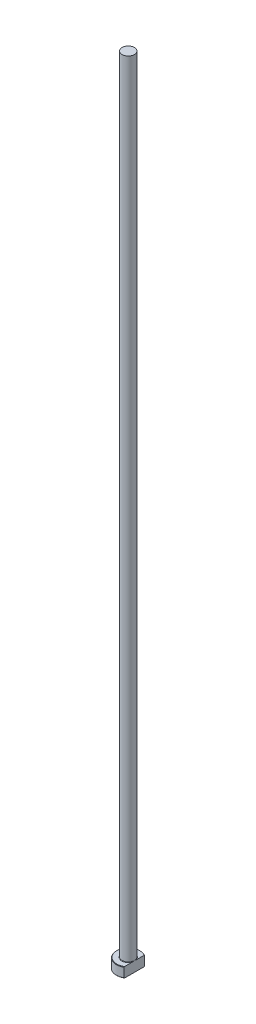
ISO-10303-21;
HEADER;
FILE_DESCRIPTION(('STEP AP214'),'2;1');
FILE_NAME('part.step','',(''),(''),'','','');
FILE_SCHEMA(('AUTOMOTIVE_DESIGN { 1 0 10303 214 1 1 1 1 }'));
ENDSEC;
DATA;
#1=APPLICATION_CONTEXT('core data for automotive mechanical design processes');
#2=APPLICATION_PROTOCOL_DEFINITION('international standard','automotive_design',2000,#1);
#3=PRODUCT_CONTEXT('',#1,'mechanical');
#4=PRODUCT('Part','Part','',(#3));
#5=PRODUCT_RELATED_PRODUCT_CATEGORY('part','',(#4));
#6=PRODUCT_DEFINITION_FORMATION('','',#4);
#7=PRODUCT_DEFINITION_CONTEXT('part definition',#1,'design');
#8=PRODUCT_DEFINITION('design','',#6,#7);
#9=PRODUCT_DEFINITION_SHAPE('','',#8);
#10=(LENGTH_UNIT() NAMED_UNIT(*) SI_UNIT(.MILLI.,.METRE.));
#11=(NAMED_UNIT(*) PLANE_ANGLE_UNIT() SI_UNIT($,.RADIAN.));
#12=(NAMED_UNIT(*) SI_UNIT($,.STERADIAN.) SOLID_ANGLE_UNIT());
#13=UNCERTAINTY_MEASURE_WITH_UNIT(LENGTH_MEASURE(1.E-05),#10,'distance_accuracy_value','');
#14=(GEOMETRIC_REPRESENTATION_CONTEXT(3) GLOBAL_UNCERTAINTY_ASSIGNED_CONTEXT((#13)) GLOBAL_UNIT_ASSIGNED_CONTEXT((#10,
#11,#12)) REPRESENTATION_CONTEXT('',''));
#15=CARTESIAN_POINT('',(0.,0.,0.));
#16=DIRECTION('',(0.,0.,1.));
#17=DIRECTION('',(1.,0.,0.));
#18=AXIS2_PLACEMENT_3D('',#15,#16,#17);
#19=CARTESIAN_POINT('',(0.,0.,0.));
#20=DIRECTION('',(0.,-1.,0.));
#21=DIRECTION('',(0.,0.,-1.));
#22=AXIS2_PLACEMENT_3D('',#19,#20,#21);
#23=PLANE('',#22);
#24=CARTESIAN_POINT('',(0.,0.,0.));
#25=DIRECTION('',(0.,-1.,0.));
#26=DIRECTION('',(0.,0.,-1.));
#27=AXIS2_PLACEMENT_3D('',#24,#25,#26);
#28=CIRCLE('',#27,5.79999999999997);
#29=CARTESIAN_POINT('',(3.09999999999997,0.,4.90204039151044));
#30=VERTEX_POINT('',#29);
#31=CARTESIAN_POINT('',(3.09999999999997,0.,-4.90204039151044));
#32=VERTEX_POINT('',#31);
#33=EDGE_CURVE('E98',#30,#32,#28,.T.);
#34=ORIENTED_EDGE('',*,*,#33,.T.);
#35=DIRECTION('',(0.,0.,1.));
#36=VECTOR('',#35,1.);
#37=CARTESIAN_POINT('',(3.09999999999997,0.,-5.13711981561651));
#38=LINE('',#37,#36);
#39=EDGE_CURVE('E83',#32,#30,#38,.T.);
#40=ORIENTED_EDGE('',*,*,#39,.T.);
#41=EDGE_LOOP('',(#34,#40));
#42=FACE_BOUND('',#41,.T.);
#43=ADVANCED_FACE('F32',(#42),#23,.T.);
#44=CARTESIAN_POINT('',(0.,259.958771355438,0.));
#45=DIRECTION('',(0.,1.,0.));
#46=DIRECTION('',(0.,0.,1.));
#47=AXIS2_PLACEMENT_3D('',#44,#45,#46);
#48=CYLINDRICAL_SURFACE('',#47,5.99999999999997);
#49=CARTESIAN_POINT('',(0.,4.80000000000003,0.));
#50=DIRECTION('',(0.,1.,0.));
#51=DIRECTION('',(0.,0.,1.));
#52=AXIS2_PLACEMENT_3D('',#49,#50,#51);
#53=CIRCLE('',#52,5.99999999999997);
#54=CARTESIAN_POINT('',(3.09999999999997,4.80000000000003,5.13711981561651));
#55=VERTEX_POINT('',#54);
#56=CARTESIAN_POINT('',(3.09999999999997,4.80000000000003,-5.13711981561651));
#57=VERTEX_POINT('',#56);
#58=EDGE_CURVE('E104',#55,#57,#53,.F.);
#59=ORIENTED_EDGE('',*,*,#58,.T.);
#60=DIRECTION('',(0.,-1.,0.));
#61=VECTOR('',#60,1.);
#62=CARTESIAN_POINT('',(3.09999999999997,400.,-5.13711981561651));
#63=LINE('',#62,#61);
#64=CARTESIAN_POINT('',(3.09999999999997,0.199999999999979,-5.13711981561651));
#65=VERTEX_POINT('',#64);
#66=EDGE_CURVE('E183',#57,#65,#63,.T.);
#67=ORIENTED_EDGE('',*,*,#66,.T.);
#68=CARTESIAN_POINT('',(0.,0.199999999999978,0.));
#69=DIRECTION('',(0.,-1.,0.));
#70=DIRECTION('',(0.,0.,-1.));
#71=AXIS2_PLACEMENT_3D('',#68,#69,#70);
#72=CIRCLE('',#71,5.99999999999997);
#73=CARTESIAN_POINT('',(3.09999999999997,0.199999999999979,5.13711981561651));
#74=VERTEX_POINT('',#73);
#75=EDGE_CURVE('E100',#65,#74,#72,.F.);
#76=ORIENTED_EDGE('',*,*,#75,.T.);
#77=DIRECTION('',(0.,-1.,0.));
#78=VECTOR('',#77,1.);
#79=CARTESIAN_POINT('',(3.09999999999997,400.,5.13711981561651));
#80=LINE('',#79,#78);
#81=EDGE_CURVE('E93',#55,#74,#80,.T.);
#82=ORIENTED_EDGE('',*,*,#81,.F.);
#83=EDGE_LOOP('',(#59,#67,#76,#82));
#84=FACE_BOUND('',#83,.T.);
#85=ADVANCED_FACE('F158',(#84),#48,.T.);
#86=CARTESIAN_POINT('',(-5.99999999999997,5.,0.));
#87=DIRECTION('',(0.,1.,0.));
#88=DIRECTION('',(0.,0.,1.));
#89=AXIS2_PLACEMENT_3D('',#86,#87,#88);
#90=PLANE('',#89);
#91=CARTESIAN_POINT('',(0.,5.,0.));
#92=DIRECTION('',(0.,1.,0.));
#93=DIRECTION('',(0.,0.,1.));
#94=AXIS2_PLACEMENT_3D('',#91,#92,#93);
#95=CIRCLE('',#94,5.79999999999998);
#96=CARTESIAN_POINT('',(3.09999999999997,5.,-4.90204039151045));
#97=VERTEX_POINT('',#96);
#98=CARTESIAN_POINT('',(3.09999999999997,5.,4.90204039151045));
#99=VERTEX_POINT('',#98);
#100=EDGE_CURVE('E178',#97,#99,#95,.T.);
#101=ORIENTED_EDGE('',*,*,#100,.T.);
#102=DIRECTION('',(0.,0.,-1.));
#103=VECTOR('',#102,1.);
#104=CARTESIAN_POINT('',(3.09999999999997,5.,0.));
#105=LINE('',#104,#103);
#106=CARTESIAN_POINT('',(3.09999999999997,4.99999999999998,1.13137084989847));
#107=VERTEX_POINT('',#106);
#108=EDGE_CURVE('E57',#99,#107,#105,.T.);
#109=ORIENTED_EDGE('',*,*,#108,.T.);
#110=CARTESIAN_POINT('',(0.,5.,0.));
#111=DIRECTION('',(0.,1.,0.));
#112=DIRECTION('',(0.,0.,1.));
#113=AXIS2_PLACEMENT_3D('',#110,#111,#112);
#114=CIRCLE('',#113,3.29999999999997);
#115=CARTESIAN_POINT('',(3.09999999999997,4.99999999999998,-1.13137084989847));
#116=VERTEX_POINT('',#115);
#117=EDGE_CURVE('E107',#107,#116,#114,.F.);
#118=ORIENTED_EDGE('',*,*,#117,.T.);
#119=EDGE_CURVE('E136',#116,#97,#105,.T.);
#120=ORIENTED_EDGE('',*,*,#119,.T.);
#121=EDGE_LOOP('',(#101,#109,#118,#120));
#122=FACE_BOUND('',#121,.T.);
#123=ADVANCED_FACE('F147',(#122),#90,.T.);
#124=CARTESIAN_POINT('',(0.,5.,0.));
#125=DIRECTION('',(0.,-1.,0.));
#126=DIRECTION('',(0.,0.,-1.));
#127=AXIS2_PLACEMENT_3D('',#124,#125,#126);
#128=CONICAL_SURFACE('',#127,5.79999999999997,0.785398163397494);
#129=ORIENTED_EDGE('',*,*,#58,.F.);
#130=CARTESIAN_POINT('',(3.09999999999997,-0.920431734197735,11.3030314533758));
#131=CARTESIAN_POINT('',(3.09999999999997,-0.688619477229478,11.0626468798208));
#132=CARTESIAN_POINT('',(3.09999999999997,-0.457063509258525,10.8220144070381));
#133=CARTESIAN_POINT('',(3.09999999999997,0.00539791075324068,10.3401205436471));
#134=CARTESIAN_POINT('',(3.09999999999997,0.236303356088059,10.0988591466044));
#135=CARTESIAN_POINT('',(3.09999999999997,0.69741098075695,9.61548494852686));
#136=CARTESIAN_POINT('',(3.09999999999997,0.927612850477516,9.3733718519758));
#137=CARTESIAN_POINT('',(3.09999999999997,1.38702344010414,8.88820676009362));
#138=CARTESIAN_POINT('',(3.09999999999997,1.61623216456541,8.64515476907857));
#139=CARTESIAN_POINT('',(3.09999999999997,2.06943803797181,8.16208218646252));
#140=CARTESIAN_POINT('',(3.09999999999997,2.29345676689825,7.92208185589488));
#141=CARTESIAN_POINT('',(3.09999999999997,2.73992554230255,7.4406269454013));
#142=CARTESIAN_POINT('',(3.09999999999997,2.96237559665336,7.19917237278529));
#143=CARTESIAN_POINT('',(3.09999999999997,3.40516728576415,6.71440911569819));
#144=CARTESIAN_POINT('',(3.09999999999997,3.6255092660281,6.47110074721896));
#145=CARTESIAN_POINT('',(3.09999999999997,4.06338097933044,5.98197014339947));
#146=CARTESIAN_POINT('',(3.09999999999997,4.28091078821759,5.736147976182));
#147=CARTESIAN_POINT('',(3.09999999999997,4.64723250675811,5.31542741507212));
#148=CARTESIAN_POINT('',(3.09999999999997,4.79703819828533,5.14141294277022));
#149=CARTESIAN_POINT('',(3.09999999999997,5.09412273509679,4.7912056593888));
#150=CARTESIAN_POINT('',(3.09999999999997,5.24140133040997,4.61501263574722));
#151=CARTESIAN_POINT('',(3.09999999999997,5.5340047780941,4.25808346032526));
#152=CARTESIAN_POINT('',(3.09999999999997,5.67929603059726,4.07731963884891));
#153=CARTESIAN_POINT('',(3.09999999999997,5.96506147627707,3.71208453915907));
#154=CARTESIAN_POINT('',(3.09999999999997,6.10553688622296,3.52761421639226));
#155=CARTESIAN_POINT('',(3.09999999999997,6.38162972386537,3.15098880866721));
#156=CARTESIAN_POINT('',(3.09999999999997,6.5171507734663,2.95876205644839));
#157=CARTESIAN_POINT('',(3.09999999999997,6.71260042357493,2.66498269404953));
#158=CARTESIAN_POINT('',(3.09999999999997,6.77649142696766,2.56607098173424));
#159=CARTESIAN_POINT('',(3.09999999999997,6.90093996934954,2.36617934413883));
#160=CARTESIAN_POINT('',(3.09999999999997,6.96149785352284,2.26519963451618));
#161=CARTESIAN_POINT('',(3.09999999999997,7.07778312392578,2.06197879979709));
#162=CARTESIAN_POINT('',(3.09999999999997,7.13355741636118,1.9597648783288));
#163=CARTESIAN_POINT('',(3.09999999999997,7.23993773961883,1.75269687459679));
#164=CARTESIAN_POINT('',(3.09999999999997,7.29054278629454,1.64784229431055));
#165=CARTESIAN_POINT('',(3.09999999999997,7.43232844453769,1.329374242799));
#166=CARTESIAN_POINT('',(3.09999999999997,7.51393038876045,1.11110705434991));
#167=CARTESIAN_POINT('',(3.09999999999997,7.60389052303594,0.78418122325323));
#168=CARTESIAN_POINT('',(3.09999999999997,7.62802295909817,0.679829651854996));
#169=CARTESIAN_POINT('',(3.09999999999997,7.66638713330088,0.46928482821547));
#170=CARTESIAN_POINT('',(3.09999999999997,7.68061997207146,0.363091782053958));
#171=CARTESIAN_POINT('',(3.09999999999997,7.69816738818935,0.150218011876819));
#172=CARTESIAN_POINT('',(3.09999999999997,7.70152516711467,0.0435409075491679));
#173=CARTESIAN_POINT('',(3.09999999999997,7.69719360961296,-0.169591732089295));
#174=CARTESIAN_POINT('',(3.09999999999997,7.68950359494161,-0.276047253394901));
#175=CARTESIAN_POINT('',(3.09999999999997,7.66373252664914,-0.486880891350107));
#176=CARTESIAN_POINT('',(3.09999999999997,7.64572733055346,-0.591268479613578));
#177=CARTESIAN_POINT('',(3.09999999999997,7.60052536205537,-0.798013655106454));
#178=CARTESIAN_POINT('',(3.09999999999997,7.57332729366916,-0.900370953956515));
#179=CARTESIAN_POINT('',(3.09999999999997,7.51094394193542,-1.10330613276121));
#180=CARTESIAN_POINT('',(3.09999999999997,7.47570859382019,-1.20386840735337));
#181=CARTESIAN_POINT('',(3.09999999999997,7.39875968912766,-1.40242722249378));
#182=CARTESIAN_POINT('',(3.09999999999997,7.35704736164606,-1.50042424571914));
#183=CARTESIAN_POINT('',(3.09999999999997,7.22811120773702,-1.78198575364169));
#184=CARTESIAN_POINT('',(3.09999999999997,7.13397777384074,-1.96237556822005));
#185=CARTESIAN_POINT('',(3.09999999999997,6.93309444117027,-2.31605883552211));
#186=CARTESIAN_POINT('',(3.09999999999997,6.82632930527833,-2.48934337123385));
#187=CARTESIAN_POINT('',(3.09999999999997,6.60386158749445,-2.83097436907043));
#188=CARTESIAN_POINT('',(3.09999999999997,6.48812633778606,-2.99929937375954));
#189=CARTESIAN_POINT('',(3.09999999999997,6.2507350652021,-3.33155975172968));
#190=CARTESIAN_POINT('',(3.09999999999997,6.12908188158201,-3.49549717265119));
#191=CARTESIAN_POINT('',(3.09999999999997,5.87989164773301,-3.82213838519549));
#192=CARTESIAN_POINT('',(3.09999999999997,5.75229938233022,-3.98479985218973));
#193=CARTESIAN_POINT('',(3.09999999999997,5.49383773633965,-4.30751445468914));
#194=CARTESIAN_POINT('',(3.09999999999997,5.36296802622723,-4.46756732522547));
#195=CARTESIAN_POINT('',(3.09999999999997,5.09906242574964,-4.78523580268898));
#196=CARTESIAN_POINT('',(3.09999999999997,4.96603235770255,-4.94285625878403));
#197=CARTESIAN_POINT('',(3.09999999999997,4.69805373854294,-5.25645943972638));
#198=CARTESIAN_POINT('',(3.09999999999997,4.56310515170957,-5.41244213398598));
#199=CARTESIAN_POINT('',(3.09999999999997,4.2080943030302,-5.81877937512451));
#200=CARTESIAN_POINT('',(3.09999999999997,3.98681570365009,-6.06807041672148));
#201=CARTESIAN_POINT('',(3.09999999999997,3.54147161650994,-6.56415415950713));
#202=CARTESIAN_POINT('',(3.09999999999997,3.31740605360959,-6.8109467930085));
#203=CARTESIAN_POINT('',(3.09999999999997,2.86701901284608,-7.30287446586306));
#204=CARTESIAN_POINT('',(3.09999999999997,2.64069567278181,-7.54800779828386));
#205=CARTESIAN_POINT('',(3.09999999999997,2.18649425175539,-8.0368296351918));
#206=CARTESIAN_POINT('',(3.09999999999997,1.95861616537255,-8.28051813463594));
#207=CARTESIAN_POINT('',(3.09999999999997,1.5108345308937,-8.75699429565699));
#208=CARTESIAN_POINT('',(3.09999999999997,1.29097841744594,-8.98982656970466));
#209=CARTESIAN_POINT('',(3.09999999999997,0.850379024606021,-9.4546514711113));
#210=CARTESIAN_POINT('',(3.09999999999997,0.629635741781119,-9.68664409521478));
#211=CARTESIAN_POINT('',(3.09999999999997,0.187673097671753,-10.1496925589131));
#212=CARTESIAN_POINT('',(3.09999999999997,-0.0335454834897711,-10.3807491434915));
#213=CARTESIAN_POINT('',(3.09999999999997,-0.476574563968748,-10.8422904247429));
#214=CARTESIAN_POINT('',(3.09999999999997,-0.698385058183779,-11.0727751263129));
#215=CARTESIAN_POINT('',(3.09999999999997,-0.920431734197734,-11.3030314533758));
#216=B_SPLINE_CURVE_WITH_KNOTS('',3,(#130,#131,#132,#133,#134,#135,#136,#137,#138,#139,#140,
#141,#142,#143,#144,#145,#146,#147,#148,#149,#150,#151,#152,#153,#154,#155,#156,#157,#158,#159,
#160,#161,#162,#163,#164,#165,#166,#167,#168,#169,#170,#171,#172,#173,#174,#175,#176,#177,#178,
#179,#180,#181,#182,#183,#184,#185,#186,#187,#188,#189,#190,#191,#192,#193,#194,#195,#196,#197,
#198,#199,#200,#201,#202,#203,#204,#205,#206,#207,#208,#209,#210,#211,#212,#213,#214,#215),
.UNSPECIFIED.,.F.,.F.,(4,2,2,2,2,2,2,2,2,2,2,2,2,2,2,2,2,2,2,2,2,2,2,2,2,2,2,2,2,2,2,2,2,2,2,2,
2,2,2,2,2,2,4),(0.,1.00184641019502,2.00370311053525,3.00595078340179,4.00819385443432,
4.9931053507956,5.97801190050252,6.9627541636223,7.94746981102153,8.6362949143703,
9.32518776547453,10.0208755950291,10.7163863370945,11.421700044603,11.7749044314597,
12.1280721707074,12.4772435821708,12.8264813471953,13.5223439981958,13.8432758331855,
14.1641719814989,14.4837917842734,14.8034312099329,15.1207496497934,15.4381128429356,
15.7575096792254,16.0768459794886,16.6863983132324,17.296693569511,17.9093265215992,
18.5216683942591,19.1418114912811,19.7620171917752,20.3807633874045,20.9995211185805,
21.9994842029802,22.9994743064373,24.0003716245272,25.0012724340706,25.961961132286,
26.9226535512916,27.882299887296,28.8419379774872),.UNSPECIFIED.);
#217=EDGE_CURVE('E135',#55,#99,#216,.T.);
#218=ORIENTED_EDGE('',*,*,#217,.T.);
#219=ORIENTED_EDGE('',*,*,#100,.F.);
#220=EDGE_CURVE('E127',#97,#57,#216,.T.);
#221=ORIENTED_EDGE('',*,*,#220,.T.);
#222=EDGE_LOOP('',(#129,#218,#219,#221));
#223=FACE_BOUND('',#222,.T.);
#224=ADVANCED_FACE('F143',(#223),#128,.T.);
#225=CARTESIAN_POINT('',(0.,0.199999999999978,0.));
#226=DIRECTION('',(0.,1.,0.));
#227=DIRECTION('',(0.,0.,1.));
#228=AXIS2_PLACEMENT_3D('',#225,#226,#227);
#229=CONICAL_SURFACE('',#228,5.99999999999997,0.785398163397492);
#230=ORIENTED_EDGE('',*,*,#75,.F.);
#231=CARTESIAN_POINT('',(3.09999999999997,5.92043173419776,-11.3030314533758));
#232=CARTESIAN_POINT('',(3.09999999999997,5.68861947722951,-11.0626468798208));
#233=CARTESIAN_POINT('',(3.09999999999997,5.45706350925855,-10.8220144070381));
#234=CARTESIAN_POINT('',(3.09999999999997,4.99460208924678,-10.3401205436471));
#235=CARTESIAN_POINT('',(3.09999999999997,4.76369664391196,-10.0988591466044));
#236=CARTESIAN_POINT('',(3.09999999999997,4.30258901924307,-9.61548494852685));
#237=CARTESIAN_POINT('',(3.09999999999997,4.0723871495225,-9.37337185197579));
#238=CARTESIAN_POINT('',(3.09999999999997,3.61297655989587,-8.88820676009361));
#239=CARTESIAN_POINT('',(3.09999999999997,3.3837678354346,-8.64515476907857));
#240=CARTESIAN_POINT('',(3.09999999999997,2.9305619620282,-8.16208218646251));
#241=CARTESIAN_POINT('',(3.09999999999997,2.70654323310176,-7.92208185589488));
#242=CARTESIAN_POINT('',(3.09999999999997,2.26007445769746,-7.4406269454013));
#243=CARTESIAN_POINT('',(3.09999999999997,2.03762440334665,-7.19917237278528));
#244=CARTESIAN_POINT('',(3.09999999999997,1.59483271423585,-6.71440911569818));
#245=CARTESIAN_POINT('',(3.09999999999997,1.3744907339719,-6.47110074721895));
#246=CARTESIAN_POINT('',(3.09999999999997,0.936619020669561,-5.98197014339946));
#247=CARTESIAN_POINT('',(3.09999999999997,0.719089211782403,-5.73614797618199));
#248=CARTESIAN_POINT('',(3.09999999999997,0.352767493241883,-5.31542741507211));
#249=CARTESIAN_POINT('',(3.09999999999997,0.202961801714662,-5.14141294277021));
#250=CARTESIAN_POINT('',(3.09999999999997,-0.0941227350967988,-4.79120565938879));
#251=CARTESIAN_POINT('',(3.09999999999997,-0.241401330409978,-4.61501263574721));
#252=CARTESIAN_POINT('',(3.09999999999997,-0.534004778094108,-4.25808346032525));
#253=CARTESIAN_POINT('',(3.09999999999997,-0.679296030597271,-4.0773196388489));
#254=CARTESIAN_POINT('',(3.09999999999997,-0.96506147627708,-3.71208453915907));
#255=CARTESIAN_POINT('',(3.09999999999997,-1.10553688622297,-3.52761421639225));
#256=CARTESIAN_POINT('',(3.09999999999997,-1.38162972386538,-3.1509888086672));
#257=CARTESIAN_POINT('',(3.09999999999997,-1.51715077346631,-2.95876205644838));
#258=CARTESIAN_POINT('',(3.09999999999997,-1.71260042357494,-2.66498269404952));
#259=CARTESIAN_POINT('',(3.09999999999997,-1.77649142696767,-2.56607098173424));
#260=CARTESIAN_POINT('',(3.09999999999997,-1.90093996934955,-2.36617934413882));
#261=CARTESIAN_POINT('',(3.09999999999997,-1.96149785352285,-2.26519963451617));
#262=CARTESIAN_POINT('',(3.09999999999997,-2.07778312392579,-2.06197879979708));
#263=CARTESIAN_POINT('',(3.09999999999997,-2.13355741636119,-1.95976487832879));
#264=CARTESIAN_POINT('',(3.09999999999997,-2.23993773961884,-1.75269687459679));
#265=CARTESIAN_POINT('',(3.09999999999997,-2.29054278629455,-1.64784229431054));
#266=CARTESIAN_POINT('',(3.09999999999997,-2.4323284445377,-1.329374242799));
#267=CARTESIAN_POINT('',(3.09999999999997,-2.51393038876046,-1.1111070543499));
#268=CARTESIAN_POINT('',(3.09999999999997,-2.60389052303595,-0.784181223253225));
#269=CARTESIAN_POINT('',(3.09999999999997,-2.62802295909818,-0.679829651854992));
#270=CARTESIAN_POINT('',(3.09999999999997,-2.66638713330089,-0.469284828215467));
#271=CARTESIAN_POINT('',(3.09999999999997,-2.68061997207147,-0.363091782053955));
#272=CARTESIAN_POINT('',(3.09999999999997,-2.69816738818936,-0.150218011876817));
#273=CARTESIAN_POINT('',(3.09999999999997,-2.70152516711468,-0.043540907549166));
#274=CARTESIAN_POINT('',(3.09999999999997,-2.69719360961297,0.169591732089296));
#275=CARTESIAN_POINT('',(3.09999999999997,-2.68950359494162,0.276047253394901));
#276=CARTESIAN_POINT('',(3.09999999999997,-2.66373252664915,0.486880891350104));
#277=CARTESIAN_POINT('',(3.09999999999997,-2.64572733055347,0.591268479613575));
#278=CARTESIAN_POINT('',(3.09999999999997,-2.60052536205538,0.798013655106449));
#279=CARTESIAN_POINT('',(3.09999999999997,-2.57332729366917,0.900370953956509));
#280=CARTESIAN_POINT('',(3.09999999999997,-2.51094394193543,1.10330613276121));
#281=CARTESIAN_POINT('',(3.09999999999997,-2.4757085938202,1.20386840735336));
#282=CARTESIAN_POINT('',(3.09999999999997,-2.39875968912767,1.40242722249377));
#283=CARTESIAN_POINT('',(3.09999999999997,-2.35704736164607,1.50042424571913));
#284=CARTESIAN_POINT('',(3.09999999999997,-2.22811120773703,1.78198575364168));
#285=CARTESIAN_POINT('',(3.09999999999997,-2.13397777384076,1.96237556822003));
#286=CARTESIAN_POINT('',(3.09999999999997,-1.93309444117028,2.31605883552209));
#287=CARTESIAN_POINT('',(3.09999999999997,-1.82632930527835,2.48934337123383));
#288=CARTESIAN_POINT('',(3.09999999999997,-1.60386158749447,2.8309743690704));
#289=CARTESIAN_POINT('',(3.09999999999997,-1.48812633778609,2.99929937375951));
#290=CARTESIAN_POINT('',(3.09999999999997,-1.25073506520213,3.33155975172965));
#291=CARTESIAN_POINT('',(3.09999999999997,-1.12908188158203,3.49549717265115));
#292=CARTESIAN_POINT('',(3.09999999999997,-0.87989164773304,3.82213838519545));
#293=CARTESIAN_POINT('',(3.09999999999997,-0.752299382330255,3.98479985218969));
#294=CARTESIAN_POINT('',(3.09999999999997,-0.493837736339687,4.30751445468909));
#295=CARTESIAN_POINT('',(3.09999999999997,-0.362968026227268,4.46756732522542));
#296=CARTESIAN_POINT('',(3.09999999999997,-0.0990624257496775,4.78523580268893));
#297=CARTESIAN_POINT('',(3.09999999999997,0.033967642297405,4.94285625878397));
#298=CARTESIAN_POINT('',(3.09999999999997,0.301946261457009,5.25645943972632));
#299=CARTESIAN_POINT('',(3.09999999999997,0.436894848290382,5.41244213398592));
#300=CARTESIAN_POINT('',(3.09999999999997,0.791905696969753,5.81877937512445));
#301=CARTESIAN_POINT('',(3.09999999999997,1.01318429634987,6.06807041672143));
#302=CARTESIAN_POINT('',(3.09999999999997,1.45852838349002,6.56415415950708));
#303=CARTESIAN_POINT('',(3.09999999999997,1.68259394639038,6.81094679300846));
#304=CARTESIAN_POINT('',(3.09999999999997,2.1329809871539,7.30287446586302));
#305=CARTESIAN_POINT('',(3.09999999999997,2.35930432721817,7.54800779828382));
#306=CARTESIAN_POINT('',(3.09999999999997,2.8135057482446,8.03682963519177));
#307=CARTESIAN_POINT('',(3.09999999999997,3.04138383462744,8.28051813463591));
#308=CARTESIAN_POINT('',(3.09999999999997,3.48916546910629,8.75699429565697));
#309=CARTESIAN_POINT('',(3.09999999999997,3.70902158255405,8.98982656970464));
#310=CARTESIAN_POINT('',(3.09999999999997,4.14962097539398,9.45465147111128));
#311=CARTESIAN_POINT('',(3.09999999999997,4.37036425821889,9.68664409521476));
#312=CARTESIAN_POINT('',(3.09999999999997,4.81232690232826,10.1496925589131));
#313=CARTESIAN_POINT('',(3.09999999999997,5.03354548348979,10.3807491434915));
#314=CARTESIAN_POINT('',(3.09999999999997,5.47657456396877,10.8422904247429));
#315=CARTESIAN_POINT('',(3.09999999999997,5.69838505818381,11.0727751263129));
#316=CARTESIAN_POINT('',(3.09999999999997,5.92043173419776,11.3030314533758));
#317=B_SPLINE_CURVE_WITH_KNOTS('',3,(#231,#232,#233,#234,#235,#236,#237,#238,#239,#240,#241,
#242,#243,#244,#245,#246,#247,#248,#249,#250,#251,#252,#253,#254,#255,#256,#257,#258,#259,#260,
#261,#262,#263,#264,#265,#266,#267,#268,#269,#270,#271,#272,#273,#274,#275,#276,#277,#278,#279,
#280,#281,#282,#283,#284,#285,#286,#287,#288,#289,#290,#291,#292,#293,#294,#295,#296,#297,#298,
#299,#300,#301,#302,#303,#304,#305,#306,#307,#308,#309,#310,#311,#312,#313,#314,#315,#316),
.UNSPECIFIED.,.F.,.F.,(4,2,2,2,2,2,2,2,2,2,2,2,2,2,2,2,2,2,2,2,2,2,2,2,2,2,2,2,2,2,2,2,2,2,2,2,
2,2,2,2,2,2,4),(0.,1.00184641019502,2.00370311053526,3.0059507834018,4.00819385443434,
4.99310535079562,5.97801190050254,6.96275416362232,7.94746981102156,8.63629491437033,
9.32518776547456,10.0208755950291,10.7163863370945,11.421700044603,11.7749044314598,
12.1280721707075,12.4772435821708,12.8264813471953,13.5223439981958,13.8432758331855,
14.1641719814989,14.4837917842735,14.8034312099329,15.1207496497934,15.4381128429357,
15.7575096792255,16.0768459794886,16.6863983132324,17.296693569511,17.9093265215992,
18.5216683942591,19.1418114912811,19.7620171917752,20.3807633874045,20.9995211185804,
21.9994842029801,22.9994743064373,24.0003716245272,25.0012724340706,25.961961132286,
26.9226535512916,27.8822998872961,28.8419379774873),.UNSPECIFIED.);
#318=EDGE_CURVE('E86',#65,#32,#317,.T.);
#319=ORIENTED_EDGE('',*,*,#318,.T.);
#320=ORIENTED_EDGE('',*,*,#33,.F.);
#321=EDGE_CURVE('E89',#30,#74,#317,.T.);
#322=ORIENTED_EDGE('',*,*,#321,.T.);
#323=EDGE_LOOP('',(#230,#319,#320,#322));
#324=FACE_BOUND('',#323,.T.);
#325=ADVANCED_FACE('F97',(#324),#229,.T.);
#326=CARTESIAN_POINT('',(0.,5.19999999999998,0.));
#327=DIRECTION('',(0.,1.,0.));
#328=DIRECTION('',(0.,0.,1.));
#329=AXIS2_PLACEMENT_3D('',#326,#327,#328);
#330=TOROIDAL_SURFACE('',#329,3.29999999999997,0.2);
#331=CARTESIAN_POINT('',(3.09999999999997,5.19999999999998,0.));
#332=CARTESIAN_POINT('',(3.09999999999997,5.20000050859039,8.63470448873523E-11));
#333=CARTESIAN_POINT('',(3.09999999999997,5.20000101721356,-1.96831350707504E-07));
#334=CARTESIAN_POINT('',(3.09999999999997,5.20000196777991,-7.43387548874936E-07));
#335=CARTESIAN_POINT('',(3.09999999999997,5.20000239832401,-1.10608751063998E-06));
#336=CARTESIAN_POINT('',(3.09999999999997,5.20000329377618,-1.97482885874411E-06));
#337=CARTESIAN_POINT('',(3.09999999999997,5.20000374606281,-2.49491365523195E-06));
#338=CARTESIAN_POINT('',(3.09999999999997,5.20000455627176,-3.57320004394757E-06));
#339=CARTESIAN_POINT('',(3.09999999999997,5.20000491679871,-4.12959627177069E-06));
#340=CARTESIAN_POINT('',(3.09999999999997,5.20000625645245,-6.28443543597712E-06));
#341=CARTESIAN_POINT('',(3.09999999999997,5.20000716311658,-7.93057681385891E-06));
#342=CARTESIAN_POINT('',(3.09999999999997,5.20000865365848,-1.11908861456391E-05));
#343=CARTESIAN_POINT('',(3.09999999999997,5.20000925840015,-1.27959111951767E-05));
#344=CARTESIAN_POINT('',(3.09999999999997,5.20001179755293,-1.95895744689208E-05));
#345=CARTESIAN_POINT('',(3.09999999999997,5.20001369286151,-2.47960258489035E-05));
#346=CARTESIAN_POINT('',(3.09999999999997,5.20001648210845,-3.46313916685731E-05));
#347=CARTESIAN_POINT('',(3.09999999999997,5.20001748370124,-3.9229578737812E-05));
#348=CARTESIAN_POINT('',(3.09999999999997,5.20002478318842,-7.34062169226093E-05));
#349=CARTESIAN_POINT('',(3.09999999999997,5.20003031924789,-0.000103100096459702));
#350=CARTESIAN_POINT('',(3.09999999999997,5.20005455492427,-0.000220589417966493));
#351=CARTESIAN_POINT('',(3.09999999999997,5.2000776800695,-0.000307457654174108));
#352=CARTESIAN_POINT('',(3.09999999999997,5.20016786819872,-0.000651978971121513));
#353=CARTESIAN_POINT('',(3.09999999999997,5.20023206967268,-0.000910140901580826));
#354=CARTESIAN_POINT('',(3.09999999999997,5.2004894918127,-0.00193760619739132));
#355=CARTESIAN_POINT('',(3.09999999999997,5.20068632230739,-0.00270624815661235));
#356=CARTESIAN_POINT('',(3.09999999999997,5.20150547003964,-0.00591366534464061));
#357=CARTESIAN_POINT('',(3.09999999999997,5.20212323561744,-0.00835327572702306));
#358=CARTESIAN_POINT('',(3.09999999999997,5.2072994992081,-0.0287840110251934));
#359=CARTESIAN_POINT('',(3.09999999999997,5.21187465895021,-0.046772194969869));
#360=CARTESIAN_POINT('',(3.09999999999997,5.22081406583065,-0.0820386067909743));
#361=CARTESIAN_POINT('',(3.09999999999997,5.22517945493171,-0.0993165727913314));
#362=CARTESIAN_POINT('',(3.09999999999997,5.23938711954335,-0.155760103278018));
#363=CARTESIAN_POINT('',(3.09999999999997,5.24916620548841,-0.19494192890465));
#364=CARTESIAN_POINT('',(3.09999999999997,5.26559812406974,-0.262010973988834));
#365=CARTESIAN_POINT('',(3.09999999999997,5.27233495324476,-0.289877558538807));
#366=CARTESIAN_POINT('',(3.09999999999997,5.28539894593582,-0.344925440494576));
#367=CARTESIAN_POINT('',(3.09999999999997,5.2917322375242,-0.372105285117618));
#368=CARTESIAN_POINT('',(3.09999999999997,5.3104657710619,-0.454441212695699));
#369=CARTESIAN_POINT('',(3.09999999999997,5.32242624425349,-0.509699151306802));
#370=CARTESIAN_POINT('',(3.09999999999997,5.34470875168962,-0.621095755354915));
#371=CARTESIAN_POINT('',(3.09999999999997,5.35501420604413,-0.677237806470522));
#372=CARTESIAN_POINT('',(3.09999999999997,5.37397233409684,-0.795308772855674));
#373=CARTESIAN_POINT('',(3.09999999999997,5.38237372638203,-0.857279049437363));
#374=CARTESIAN_POINT('',(3.09999999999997,5.39483964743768,-0.981488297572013));
#375=CARTESIAN_POINT('',(3.09999999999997,5.39891956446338,-1.04372551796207));
#376=CARTESIAN_POINT('',(3.09999999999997,5.4002522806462,-1.1364625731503));
#377=CARTESIAN_POINT('',(3.09999999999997,5.39992868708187,-1.16692514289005));
#378=CARTESIAN_POINT('',(3.09999999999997,5.39736890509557,-1.22783403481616));
#379=CARTESIAN_POINT('',(3.09999999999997,5.39512949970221,-1.25828024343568));
#380=CARTESIAN_POINT('',(3.09999999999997,5.3882758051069,-1.31816284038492));
#381=CARTESIAN_POINT('',(3.09999999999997,5.38372059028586,-1.34760578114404));
#382=CARTESIAN_POINT('',(3.09999999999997,5.37149785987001,-1.40581436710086));
#383=CARTESIAN_POINT('',(3.09999999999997,5.36383981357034,-1.43458179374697));
#384=CARTESIAN_POINT('',(3.09999999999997,5.34913051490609,-1.47610977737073));
#385=CARTESIAN_POINT('',(3.09999999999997,5.34380195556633,-1.48947638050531));
#386=CARTESIAN_POINT('',(3.09999999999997,5.33179609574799,-1.51565425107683));
#387=CARTESIAN_POINT('',(3.09999999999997,5.32511527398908,-1.52846396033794));
#388=CARTESIAN_POINT('',(3.09999999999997,5.31156812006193,-1.55058530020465));
#389=CARTESIAN_POINT('',(3.09999999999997,5.30500876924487,-1.56008264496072));
#390=CARTESIAN_POINT('',(3.09999999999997,5.29056237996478,-1.5780097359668));
#391=CARTESIAN_POINT('',(3.09999999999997,5.28267975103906,-1.58644287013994));
#392=CARTESIAN_POINT('',(3.09999999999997,5.26899499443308,-1.59836257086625));
#393=CARTESIAN_POINT('',(3.09999999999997,5.26370979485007,-1.60243897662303));
#394=CARTESIAN_POINT('',(3.09999999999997,5.25259769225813,-1.60977856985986));
#395=CARTESIAN_POINT('',(3.09999999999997,5.24677147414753,-1.61304276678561));
#396=CARTESIAN_POINT('',(3.09999999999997,5.23558966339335,-1.61807105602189));
#397=CARTESIAN_POINT('',(3.09999999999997,5.23030479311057,-1.61999055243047));
#398=CARTESIAN_POINT('',(3.09999999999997,5.21948724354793,-1.62291762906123));
#399=CARTESIAN_POINT('',(3.09999999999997,5.21395478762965,-1.62392601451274));
#400=CARTESIAN_POINT('',(3.09999999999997,5.20277366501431,-1.62493544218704));
#401=CARTESIAN_POINT('',(3.09999999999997,5.19712461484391,-1.62493233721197));
#402=CARTESIAN_POINT('',(3.09999999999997,5.18591949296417,-1.62390846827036));
#403=CARTESIAN_POINT('',(3.09999999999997,5.1803634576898,-1.62288731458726));
#404=CARTESIAN_POINT('',(3.09999999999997,5.16982009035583,-1.62001450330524));
#405=CARTESIAN_POINT('',(3.09999999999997,5.16481843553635,-1.61821408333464));
#406=CARTESIAN_POINT('',(3.09999999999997,5.15512149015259,-1.61392929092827));
#407=CARTESIAN_POINT('',(3.09999999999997,5.15042629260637,-1.61144471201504));
#408=CARTESIAN_POINT('',(3.09999999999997,5.13843536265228,-1.60413057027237));
#409=CARTESIAN_POINT('',(3.09999999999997,5.13143004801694,-1.59882575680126));
#410=CARTESIAN_POINT('',(3.09999999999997,5.11831643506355,-1.5871999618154));
#411=CARTESIAN_POINT('',(3.09999999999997,5.1122112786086,-1.58087557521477));
#412=CARTESIAN_POINT('',(3.09999999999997,5.09648912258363,-1.56251896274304));
#413=CARTESIAN_POINT('',(3.09999999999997,5.08770172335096,-1.54978301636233));
#414=CARTESIAN_POINT('',(3.09999999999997,5.07201622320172,-1.52323986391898));
#415=CARTESIAN_POINT('',(3.09999999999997,5.06512028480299,-1.50943145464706));
#416=CARTESIAN_POINT('',(3.09999999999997,5.05247518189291,-1.48047677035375));
#417=CARTESIAN_POINT('',(3.09999999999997,5.04680124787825,-1.46529814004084));
#418=CARTESIAN_POINT('',(3.09999999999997,5.03672275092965,-1.43451819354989));
#419=CARTESIAN_POINT('',(3.09999999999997,5.03231964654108,-1.41891641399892));
#420=CARTESIAN_POINT('',(3.09999999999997,5.02058030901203,-1.37142005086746));
#421=CARTESIAN_POINT('',(3.09999999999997,5.01483238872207,-1.3391366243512));
#422=CARTESIAN_POINT('',(3.09999999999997,5.00376797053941,-1.25503165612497));
#423=CARTESIAN_POINT('',(3.09999999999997,5.00071471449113,-1.20294070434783));
#424=CARTESIAN_POINT('',(3.09999999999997,4.99950954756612,-1.09856941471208));
#425=CARTESIAN_POINT('',(3.09999999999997,5.00137734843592,-1.04628915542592));
#426=CARTESIAN_POINT('',(3.09999999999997,5.00844280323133,-0.944923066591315));
#427=CARTESIAN_POINT('',(3.09999999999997,5.01344756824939,-0.895822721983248));
#428=CARTESIAN_POINT('',(3.09999999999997,5.02575896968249,-0.798308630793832));
#429=CARTESIAN_POINT('',(3.09999999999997,5.03304750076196,-0.749892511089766));
#430=CARTESIAN_POINT('',(3.09999999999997,5.04953811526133,-0.652335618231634));
#431=CARTESIAN_POINT('',(3.09999999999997,5.05877753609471,-0.603201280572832));
#432=CARTESIAN_POINT('',(3.09999999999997,5.07884455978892,-0.503941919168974));
#433=CARTESIAN_POINT('',(3.09999999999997,5.08970698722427,-0.453824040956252));
#434=CARTESIAN_POINT('',(3.09999999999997,5.10895219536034,-0.369008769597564));
#435=CARTESIAN_POINT('',(3.09999999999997,5.11708529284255,-0.334253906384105));
#436=CARTESIAN_POINT('',(3.09999999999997,5.13360118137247,-0.265211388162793));
#437=CARTESIAN_POINT('',(3.09999999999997,5.14198019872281,-0.230922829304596));
#438=CARTESIAN_POINT('',(3.09999999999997,5.15798158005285,-0.16629806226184));
#439=CARTESIAN_POINT('',(3.09999999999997,5.16558151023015,-0.135956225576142));
#440=CARTESIAN_POINT('',(3.09999999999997,5.1812139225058,-0.0740081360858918));
#441=CARTESIAN_POINT('',(3.09999999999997,5.18925105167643,-0.0424030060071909));
#442=CARTESIAN_POINT('',(3.09999999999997,5.19787768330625,-0.0083493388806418));
#443=CARTESIAN_POINT('',(3.09999999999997,5.1984965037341,-0.00590581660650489));
#444=CARTESIAN_POINT('',(3.09999999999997,5.19931589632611,-0.00269751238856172));
#445=CARTESIAN_POINT('',(3.09999999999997,5.19951194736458,-0.00193190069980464));
#446=CARTESIAN_POINT('',(3.09999999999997,5.1997684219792,-0.000908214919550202));
#447=CARTESIAN_POINT('',(3.09999999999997,5.19983243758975,-0.000650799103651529));
#448=CARTESIAN_POINT('',(3.09999999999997,5.19992240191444,-0.00030714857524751));
#449=CARTESIAN_POINT('',(3.09999999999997,5.19994549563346,-0.000220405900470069));
#450=CARTESIAN_POINT('',(3.09999999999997,5.19996970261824,-0.000103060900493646));
#451=CARTESIAN_POINT('',(3.09999999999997,5.19997523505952,-7.33845004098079E-05));
#452=CARTESIAN_POINT('',(3.09999999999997,5.19998252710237,-3.92257131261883E-05));
#453=CARTESIAN_POINT('',(3.09999999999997,5.19998352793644,-3.462848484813E-05));
#454=CARTESIAN_POINT('',(3.09999999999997,5.1999863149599,-2.4795096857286E-05));
#455=CARTESIAN_POINT('',(3.09999999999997,5.19998820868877,-1.95896135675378E-05));
#456=CARTESIAN_POINT('',(3.09999999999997,5.19999074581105,-1.2796958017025E-05));
#457=CARTESIAN_POINT('',(3.09999999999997,5.1999913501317,-1.11920046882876E-05));
#458=CARTESIAN_POINT('',(3.09999999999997,5.19999283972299,-7.93177065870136E-06));
#459=CARTESIAN_POINT('',(3.09999999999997,5.19999374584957,-6.28562370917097E-06));
#460=CARTESIAN_POINT('',(3.09999999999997,5.19999508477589,-4.13069797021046E-06));
#461=CARTESIAN_POINT('',(3.09999999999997,5.1999954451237,-3.57425625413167E-06));
#462=CARTESIAN_POINT('',(3.09999999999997,5.19999625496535,-2.49584654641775E-06));
#463=CARTESIAN_POINT('',(3.09999999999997,5.19999670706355,-1.97568269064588E-06));
#464=CARTESIAN_POINT('',(3.09999999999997,5.19999760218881,-1.10675611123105E-06));
#465=CARTESIAN_POINT('',(3.09999999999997,5.19999803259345,-7.4395710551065E-07));
#466=CARTESIAN_POINT('',(3.09999999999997,5.19999898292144,-1.97149804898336E-07));
#467=CARTESIAN_POINT('',(3.09999999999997,5.19999949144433,-8.63411446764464E-11));
#468=CARTESIAN_POINT('',(3.09999999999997,5.19999999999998,0.));
#469=B_SPLINE_CURVE_WITH_KNOTS('',3,(#331,#332,#333,#334,#335,#336,#337,#338,#339,#340,#341,
#342,#343,#344,#345,#346,#347,#348,#349,#350,#351,#352,#353,#354,#355,#356,#357,#358,#359,#360,
#361,#362,#363,#364,#365,#366,#367,#368,#369,#370,#371,#372,#373,#374,#375,#376,#377,#378,#379,
#380,#381,#382,#383,#384,#385,#386,#387,#388,#389,#390,#391,#392,#393,#394,#395,#396,#397,#398,
#399,#400,#401,#402,#403,#404,#405,#406,#407,#408,#409,#410,#411,#412,#413,#414,#415,#416,#417,
#418,#419,#420,#421,#422,#423,#424,#425,#426,#427,#428,#429,#430,#431,#432,#433,#434,#435,#436,
#437,#438,#439,#440,#441,#442,#443,#444,#445,#446,#447,#448,#449,#450,#451,#452,#453,#454,#455,
#456,#457,#458,#459,#460,#461,#462,#463,#464,#465,#466,#467,#468),.UNSPECIFIED.,.T.,.F.,(4,2,2,
2,2,2,2,2,2,2,2,2,2,2,2,2,2,2,2,2,2,2,2,2,2,2,2,2,2,2,2,2,2,2,2,2,2,2,2,2,2,2,2,2,2,2,2,2,2,2,2,
2,2,2,2,2,2,2,2,2,2,2,2,2,2,2,2,2,4),(0.,1.53981331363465E-06,3.23033975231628E-06,
5.28553578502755E-06,7.27344647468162E-06,1.28910817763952E-05,1.8031960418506E-05,
3.46255039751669E-05,4.8726433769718E-05,0.000139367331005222,0.000408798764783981,
0.0012071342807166,0.00358714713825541,0.0111373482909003,0.0668184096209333,0.120281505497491,
0.241431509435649,0.327438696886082,0.411161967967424,0.580755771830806,0.751954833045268,
0.939477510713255,1.12633017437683,1.21767988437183,1.30918328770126,1.39846159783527,
1.48746947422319,1.53058836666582,1.57382101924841,1.60836719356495,1.64280045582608,
1.66276990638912,1.68271441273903,1.69951299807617,1.71629672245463,1.73314926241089,
1.75000825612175,1.76589594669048,1.78178843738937,1.80799762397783,1.83429622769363,
1.88045465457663,1.9266656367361,1.97520355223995,2.02379695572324,2.12194851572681,
2.27811623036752,2.43491043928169,2.58289937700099,2.7297435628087,2.87970504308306,
3.03353547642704,3.14061512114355,3.24650617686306,3.34034416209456,3.4381742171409,
3.44573655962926,3.44810718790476,3.44890321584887,3.44917225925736,3.44926284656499,
3.44927694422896,3.44929353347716,3.44929867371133,3.44930429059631,3.44930627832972,
3.44930833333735,3.44931002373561,3.4493115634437),.UNSPECIFIED.);
#470=CARTESIAN_POINT('',(3.09999999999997,5.19999999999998,0.));
#471=VERTEX_POINT('',#470);
#472=EDGE_CURVE('E11',#116,#471,#469,.T.);
#473=ORIENTED_EDGE('',*,*,#472,.F.);
#474=ORIENTED_EDGE('',*,*,#117,.F.);
#475=CARTESIAN_POINT('',(3.09999999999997,5.19999999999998,0.));
#476=CARTESIAN_POINT('',(3.09999999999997,5.19999949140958,-8.63470557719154E-11));
#477=CARTESIAN_POINT('',(3.09999999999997,5.19999898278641,1.96831350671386E-07));
#478=CARTESIAN_POINT('',(3.09999999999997,5.19999803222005,7.43387548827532E-07));
#479=CARTESIAN_POINT('',(3.09999999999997,5.19999760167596,1.10608751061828E-06));
#480=CARTESIAN_POINT('',(3.09999999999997,5.19999670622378,1.97482885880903E-06));
#481=CARTESIAN_POINT('',(3.09999999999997,5.19999625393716,2.49491365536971E-06));
#482=CARTESIAN_POINT('',(3.09999999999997,5.1999954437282,3.57320004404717E-06));
#483=CARTESIAN_POINT('',(3.09999999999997,5.19999508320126,4.12959627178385E-06));
#484=CARTESIAN_POINT('',(3.09999999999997,5.19999374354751,6.28443543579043E-06));
#485=CARTESIAN_POINT('',(3.09999999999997,5.19999283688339,7.93057681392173E-06));
#486=CARTESIAN_POINT('',(3.09999999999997,5.19999134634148,1.1190886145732E-05));
#487=CARTESIAN_POINT('',(3.09999999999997,5.19999074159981,1.27959111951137E-05));
#488=CARTESIAN_POINT('',(3.09999999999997,5.19998820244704,1.95895744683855E-05));
#489=CARTESIAN_POINT('',(3.09999999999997,5.19998630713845,2.47960258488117E-05));
#490=CARTESIAN_POINT('',(3.09999999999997,5.19998351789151,3.4631391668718E-05));
#491=CARTESIAN_POINT('',(3.09999999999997,5.19998251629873,3.9229578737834E-05));
#492=CARTESIAN_POINT('',(3.09999999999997,5.19997521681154,7.34062169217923E-05));
#493=CARTESIAN_POINT('',(3.09999999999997,5.19996968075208,0.000103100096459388));
#494=CARTESIAN_POINT('',(3.09999999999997,5.1999454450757,0.000220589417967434));
#495=CARTESIAN_POINT('',(3.09999999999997,5.19992231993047,0.000307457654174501));
#496=CARTESIAN_POINT('',(3.09999999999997,5.19983213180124,0.000651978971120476));
#497=CARTESIAN_POINT('',(3.09999999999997,5.19976793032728,0.00091014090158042));
#498=CARTESIAN_POINT('',(3.09999999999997,5.19951050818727,0.00193760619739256));
#499=CARTESIAN_POINT('',(3.09999999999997,5.19931367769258,0.00270624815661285));
#500=CARTESIAN_POINT('',(3.09999999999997,5.19849452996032,0.00591366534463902));
#501=CARTESIAN_POINT('',(3.09999999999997,5.19787676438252,0.00835327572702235));
#502=CARTESIAN_POINT('',(3.09999999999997,5.19270050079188,0.0287840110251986));
#503=CARTESIAN_POINT('',(3.09999999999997,5.18812534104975,0.0467721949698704));
#504=CARTESIAN_POINT('',(3.09999999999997,5.17918593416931,0.0820386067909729));
#505=CARTESIAN_POINT('',(3.09999999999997,5.17482054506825,0.0993165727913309));
#506=CARTESIAN_POINT('',(3.09999999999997,5.16061288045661,0.15576010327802));
#507=CARTESIAN_POINT('',(3.09999999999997,5.15083379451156,0.194941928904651));
#508=CARTESIAN_POINT('',(3.09999999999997,5.13440187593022,0.262010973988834));
#509=CARTESIAN_POINT('',(3.09999999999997,5.12766504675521,0.289877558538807));
#510=CARTESIAN_POINT('',(3.09999999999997,5.11460105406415,0.344925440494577));
#511=CARTESIAN_POINT('',(3.09999999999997,5.10826776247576,0.372105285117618));
#512=CARTESIAN_POINT('',(3.09999999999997,5.08953422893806,0.454441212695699));
#513=CARTESIAN_POINT('',(3.09999999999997,5.07757375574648,0.509699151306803));
#514=CARTESIAN_POINT('',(3.09999999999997,5.05529124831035,0.621095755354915));
#515=CARTESIAN_POINT('',(3.09999999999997,5.04498579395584,0.677237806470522));
#516=CARTESIAN_POINT('',(3.09999999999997,5.02602766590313,0.795308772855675));
#517=CARTESIAN_POINT('',(3.09999999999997,5.01762627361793,0.857279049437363));
#518=CARTESIAN_POINT('',(3.09999999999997,5.00516035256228,0.981488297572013));
#519=CARTESIAN_POINT('',(3.09999999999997,5.00108043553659,1.04372551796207));
#520=CARTESIAN_POINT('',(3.09999999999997,4.99974771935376,1.1364625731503));
#521=CARTESIAN_POINT('',(3.09999999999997,5.0000713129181,1.16692514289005));
#522=CARTESIAN_POINT('',(3.09999999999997,5.00263109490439,1.22783403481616));
#523=CARTESIAN_POINT('',(3.09999999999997,5.00487050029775,1.25828024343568));
#524=CARTESIAN_POINT('',(3.09999999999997,5.01172419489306,1.31816284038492));
#525=CARTESIAN_POINT('',(3.09999999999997,5.0162794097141,1.34760578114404));
#526=CARTESIAN_POINT('',(3.09999999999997,5.02850214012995,1.40581436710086));
#527=CARTESIAN_POINT('',(3.09999999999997,5.03616018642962,1.43458179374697));
#528=CARTESIAN_POINT('',(3.09999999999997,5.05086948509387,1.47610977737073));
#529=CARTESIAN_POINT('',(3.09999999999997,5.05619804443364,1.48947638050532));
#530=CARTESIAN_POINT('',(3.09999999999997,5.06820390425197,1.51565425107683));
#531=CARTESIAN_POINT('',(3.09999999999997,5.07488472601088,1.52846396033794));
#532=CARTESIAN_POINT('',(3.09999999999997,5.08843187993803,1.55058530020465));
#533=CARTESIAN_POINT('',(3.09999999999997,5.0949912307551,1.56008264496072));
#534=CARTESIAN_POINT('',(3.09999999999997,5.10943762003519,1.5780097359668));
#535=CARTESIAN_POINT('',(3.09999999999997,5.11732024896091,1.58644287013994));
#536=CARTESIAN_POINT('',(3.09999999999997,5.13100500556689,1.59836257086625));
#537=CARTESIAN_POINT('',(3.09999999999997,5.1362902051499,1.60243897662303));
#538=CARTESIAN_POINT('',(3.09999999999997,5.14740230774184,1.60977856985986));
#539=CARTESIAN_POINT('',(3.09999999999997,5.15322852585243,1.61304276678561));
#540=CARTESIAN_POINT('',(3.09999999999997,5.16441033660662,1.61807105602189));
#541=CARTESIAN_POINT('',(3.09999999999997,5.16969520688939,1.61999055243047));
#542=CARTESIAN_POINT('',(3.09999999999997,5.18051275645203,1.62291762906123));
#543=CARTESIAN_POINT('',(3.09999999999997,5.18604521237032,1.62392601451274));
#544=CARTESIAN_POINT('',(3.09999999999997,5.19722633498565,1.62493544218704));
#545=CARTESIAN_POINT('',(3.09999999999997,5.20287538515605,1.62493233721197));
#546=CARTESIAN_POINT('',(3.09999999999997,5.21408050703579,1.62390846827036));
#547=CARTESIAN_POINT('',(3.09999999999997,5.21963654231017,1.62288731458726));
#548=CARTESIAN_POINT('',(3.09999999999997,5.23017990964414,1.62001450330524));
#549=CARTESIAN_POINT('',(3.09999999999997,5.23518156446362,1.61821408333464));
#550=CARTESIAN_POINT('',(3.09999999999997,5.24487850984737,1.61392929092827));
#551=CARTESIAN_POINT('',(3.09999999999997,5.2495737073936,1.61144471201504));
#552=CARTESIAN_POINT('',(3.09999999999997,5.26156463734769,1.60413057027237));
#553=CARTESIAN_POINT('',(3.09999999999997,5.26856995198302,1.59882575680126));
#554=CARTESIAN_POINT('',(3.09999999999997,5.28168356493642,1.5871999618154));
#555=CARTESIAN_POINT('',(3.09999999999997,5.28778872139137,1.58087557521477));
#556=CARTESIAN_POINT('',(3.09999999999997,5.30351087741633,1.56251896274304));
#557=CARTESIAN_POINT('',(3.09999999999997,5.312298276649,1.54978301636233));
#558=CARTESIAN_POINT('',(3.09999999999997,5.32798377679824,1.52323986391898));
#559=CARTESIAN_POINT('',(3.09999999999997,5.33487971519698,1.50943145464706));
#560=CARTESIAN_POINT('',(3.09999999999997,5.34752481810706,1.48047677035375));
#561=CARTESIAN_POINT('',(3.09999999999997,5.35319875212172,1.46529814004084));
#562=CARTESIAN_POINT('',(3.09999999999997,5.36327724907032,1.43451819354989));
#563=CARTESIAN_POINT('',(3.09999999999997,5.36768035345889,1.41891641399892));
#564=CARTESIAN_POINT('',(3.09999999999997,5.37941969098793,1.37142005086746));
#565=CARTESIAN_POINT('',(3.09999999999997,5.3851676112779,1.33913662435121));
#566=CARTESIAN_POINT('',(3.09999999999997,5.39623202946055,1.25503165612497));
#567=CARTESIAN_POINT('',(3.09999999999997,5.39928528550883,1.20294070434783));
#568=CARTESIAN_POINT('',(3.09999999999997,5.40049045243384,1.09856941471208));
#569=CARTESIAN_POINT('',(3.09999999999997,5.39862265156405,1.04628915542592));
#570=CARTESIAN_POINT('',(3.09999999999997,5.39155719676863,0.944923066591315));
#571=CARTESIAN_POINT('',(3.09999999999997,5.38655243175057,0.895822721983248));
#572=CARTESIAN_POINT('',(3.09999999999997,5.37424103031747,0.798308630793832));
#573=CARTESIAN_POINT('',(3.09999999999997,5.36695249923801,0.749892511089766));
#574=CARTESIAN_POINT('',(3.09999999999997,5.35046188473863,0.652335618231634));
#575=CARTESIAN_POINT('',(3.09999999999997,5.34122246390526,0.603201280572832));
#576=CARTESIAN_POINT('',(3.09999999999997,5.32115544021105,0.503941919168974));
#577=CARTESIAN_POINT('',(3.09999999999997,5.3102930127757,0.453824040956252));
#578=CARTESIAN_POINT('',(3.09999999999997,5.29104780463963,0.369008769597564));
#579=CARTESIAN_POINT('',(3.09999999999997,5.28291470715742,0.334253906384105));
#580=CARTESIAN_POINT('',(3.09999999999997,5.2663988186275,0.265211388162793));
#581=CARTESIAN_POINT('',(3.09999999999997,5.25801980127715,0.230922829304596));
#582=CARTESIAN_POINT('',(3.09999999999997,5.24201841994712,0.16629806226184));
#583=CARTESIAN_POINT('',(3.09999999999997,5.23441848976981,0.135956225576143));
#584=CARTESIAN_POINT('',(3.09999999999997,5.21878607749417,0.0740081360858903));
#585=CARTESIAN_POINT('',(3.09999999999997,5.21074894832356,0.0424030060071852));
#586=CARTESIAN_POINT('',(3.09999999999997,5.20212231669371,0.00834933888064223));
#587=CARTESIAN_POINT('',(3.09999999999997,5.20150349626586,0.00590581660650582));
#588=CARTESIAN_POINT('',(3.09999999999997,5.20068410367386,0.0026975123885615));
#589=CARTESIAN_POINT('',(3.09999999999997,5.20048805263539,0.00193190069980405));
#590=CARTESIAN_POINT('',(3.09999999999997,5.20023157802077,0.000908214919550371));
#591=CARTESIAN_POINT('',(3.09999999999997,5.20016756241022,0.000650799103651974));
#592=CARTESIAN_POINT('',(3.09999999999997,5.20007759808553,0.000307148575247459));
#593=CARTESIAN_POINT('',(3.09999999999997,5.20005450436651,0.000220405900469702));
#594=CARTESIAN_POINT('',(3.09999999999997,5.20003029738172,0.000103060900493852));
#595=CARTESIAN_POINT('',(3.09999999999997,5.20002476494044,7.33845004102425E-05));
#596=CARTESIAN_POINT('',(3.09999999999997,5.20001747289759,3.92257131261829E-05));
#597=CARTESIAN_POINT('',(3.09999999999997,5.20001647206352,3.46284848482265E-05));
#598=CARTESIAN_POINT('',(3.09999999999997,5.20001368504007,2.47950968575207E-05));
#599=CARTESIAN_POINT('',(3.09999999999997,5.20001179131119,1.95896135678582E-05));
#600=CARTESIAN_POINT('',(3.09999999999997,5.20000925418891,1.27969580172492E-05));
#601=CARTESIAN_POINT('',(3.09999999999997,5.20000864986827,1.11920046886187E-05));
#602=CARTESIAN_POINT('',(3.09999999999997,5.20000716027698,7.93177065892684E-06));
#603=CARTESIAN_POINT('',(3.09999999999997,5.20000625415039,6.28562370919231E-06));
#604=CARTESIAN_POINT('',(3.09999999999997,5.20000491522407,4.13069797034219E-06));
#605=CARTESIAN_POINT('',(3.09999999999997,5.20000455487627,3.57425625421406E-06));
#606=CARTESIAN_POINT('',(3.09999999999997,5.20000374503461,2.4958465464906E-06));
#607=CARTESIAN_POINT('',(3.09999999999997,5.20000329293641,1.97568269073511E-06));
#608=CARTESIAN_POINT('',(3.09999999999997,5.20000239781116,1.10675611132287E-06));
#609=CARTESIAN_POINT('',(3.09999999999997,5.20000196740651,7.43957105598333E-07));
#610=CARTESIAN_POINT('',(3.09999999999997,5.20000101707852,1.97149804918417E-07));
#611=CARTESIAN_POINT('',(3.09999999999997,5.20000050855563,8.63411555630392E-11));
#612=CARTESIAN_POINT('',(3.09999999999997,5.19999999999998,0.));
#613=B_SPLINE_CURVE_WITH_KNOTS('',3,(#475,#476,#477,#478,#479,#480,#481,#482,#483,#484,#485,
#486,#487,#488,#489,#490,#491,#492,#493,#494,#495,#496,#497,#498,#499,#500,#501,#502,#503,#504,
#505,#506,#507,#508,#509,#510,#511,#512,#513,#514,#515,#516,#517,#518,#519,#520,#521,#522,#523,
#524,#525,#526,#527,#528,#529,#530,#531,#532,#533,#534,#535,#536,#537,#538,#539,#540,#541,#542,
#543,#544,#545,#546,#547,#548,#549,#550,#551,#552,#553,#554,#555,#556,#557,#558,#559,#560,#561,
#562,#563,#564,#565,#566,#567,#568,#569,#570,#571,#572,#573,#574,#575,#576,#577,#578,#579,#580,
#581,#582,#583,#584,#585,#586,#587,#588,#589,#590,#591,#592,#593,#594,#595,#596,#597,#598,#599,
#600,#601,#602,#603,#604,#605,#606,#607,#608,#609,#610,#611,#612),.UNSPECIFIED.,.T.,.F.,(4,2,2,
2,2,2,2,2,2,2,2,2,2,2,2,2,2,2,2,2,2,2,2,2,2,2,2,2,2,2,2,2,2,2,2,2,2,2,2,2,2,2,2,2,2,2,2,2,2,2,2,
2,2,2,2,2,2,2,2,2,2,2,2,2,2,2,2,2,4),(0.,1.53981331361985E-06,3.23033975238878E-06,
5.28553578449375E-06,7.27344647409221E-06,1.28910817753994E-05,1.80319604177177E-05,
3.4625503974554E-05,4.87264337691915E-05,0.000139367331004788,0.000408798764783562,
0.00120713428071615,0.00358714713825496,0.0111373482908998,0.0668184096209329,0.120281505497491,
0.241431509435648,0.327438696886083,0.411161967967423,0.580755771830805,0.751954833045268,
0.939477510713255,1.12633017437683,1.21767988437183,1.30918328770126,1.39846159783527,
1.48746947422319,1.53058836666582,1.57382101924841,1.60836719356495,1.64280045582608,
1.66276990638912,1.68271441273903,1.69951299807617,1.71629672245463,1.73314926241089,
1.75000825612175,1.76589594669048,1.78178843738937,1.80799762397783,1.83429622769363,
1.88045465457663,1.9266656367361,1.97520355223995,2.02379695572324,2.12194851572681,
2.27811623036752,2.43491043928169,2.582899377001,2.7297435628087,2.87970504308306,
3.03353547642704,3.14061512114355,3.24650617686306,3.34034416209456,3.4381742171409,
3.44573655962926,3.44810718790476,3.44890321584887,3.44917225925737,3.44926284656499,
3.44927694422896,3.44929353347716,3.44929867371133,3.44930429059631,3.44930627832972,
3.44930833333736,3.44931002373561,3.4493115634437),.UNSPECIFIED.);
#614=EDGE_CURVE('E46',#471,#107,#613,.T.);
#615=ORIENTED_EDGE('',*,*,#614,.F.);
#616=CARTESIAN_POINT('',(0.,5.19999999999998,0.));
#617=DIRECTION('',(0.,1.,0.));
#618=DIRECTION('',(0.,0.,1.));
#619=AXIS2_PLACEMENT_3D('',#616,#617,#618);
#620=CIRCLE('',#619,3.09999999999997);
#621=EDGE_CURVE('E103',#471,#471,#620,.T.);
#622=ORIENTED_EDGE('',*,*,#621,.F.);
#623=EDGE_LOOP('',(#473,#474,#615,#622));
#624=FACE_BOUND('',#623,.T.);
#625=ADVANCED_FACE('F34',(#624),#330,.F.);
#626=CARTESIAN_POINT('',(0.,259.958771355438,0.));
#627=DIRECTION('',(0.,1.,0.));
#628=DIRECTION('',(0.,0.,1.));
#629=AXIS2_PLACEMENT_3D('',#626,#627,#628);
#630=CYLINDRICAL_SURFACE('',#629,3.09999999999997);
#631=ORIENTED_EDGE('',*,*,#621,.T.);
#632=EDGE_LOOP('',(#631));
#633=FACE_BOUND('',#632,.T.);
#634=CARTESIAN_POINT('',(0.,400.,0.));
#635=DIRECTION('',(0.,1.,0.));
#636=DIRECTION('',(0.,0.,1.));
#637=AXIS2_PLACEMENT_3D('',#634,#635,#636);
#638=CIRCLE('',#637,3.09999999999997);
#639=CARTESIAN_POINT('',(0.,400.,3.09999999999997));
#640=VERTEX_POINT('',#639);
#641=EDGE_CURVE('E101',#640,#640,#638,.T.);
#642=ORIENTED_EDGE('',*,*,#641,.F.);
#643=EDGE_LOOP('',(#642));
#644=FACE_BOUND('',#643,.T.);
#645=ADVANCED_FACE('F155',(#633,#644),#630,.T.);
#646=CARTESIAN_POINT('',(-3.09999999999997,400.,0.));
#647=DIRECTION('',(0.,1.,0.));
#648=DIRECTION('',(0.,0.,1.));
#649=AXIS2_PLACEMENT_3D('',#646,#647,#648);
#650=PLANE('',#649);
#651=ORIENTED_EDGE('',*,*,#641,.T.);
#652=EDGE_LOOP('',(#651));
#653=FACE_BOUND('',#652,.T.);
#654=ADVANCED_FACE('F121',(#653),#650,.T.);
#655=CARTESIAN_POINT('',(3.09999999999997,400.,-5.13711981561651));
#656=DIRECTION('',(1.,0.,0.));
#657=DIRECTION('',(0.,0.,-1.));
#658=AXIS2_PLACEMENT_3D('',#655,#656,#657);
#659=PLANE('',#658);
#660=ORIENTED_EDGE('',*,*,#66,.F.);
#661=ORIENTED_EDGE('',*,*,#220,.F.);
#662=ORIENTED_EDGE('',*,*,#119,.F.);
#663=ORIENTED_EDGE('',*,*,#472,.T.);
#664=ORIENTED_EDGE('',*,*,#614,.T.);
#665=ORIENTED_EDGE('',*,*,#108,.F.);
#666=ORIENTED_EDGE('',*,*,#217,.F.);
#667=ORIENTED_EDGE('',*,*,#81,.T.);
#668=ORIENTED_EDGE('',*,*,#321,.F.);
#669=ORIENTED_EDGE('',*,*,#39,.F.);
#670=ORIENTED_EDGE('',*,*,#318,.F.);
#671=EDGE_LOOP('',(#660,#661,#662,#663,#664,#665,#666,#667,#668,#669,#670));
#672=FACE_BOUND('',#671,.T.);
#673=ADVANCED_FACE('F85',(#672),#659,.T.);
#674=CLOSED_SHELL('',(#43,#85,#123,#224,#325,#625,#645,#654,#673));
#675=MANIFOLD_SOLID_BREP('B2',#674);
#676=ADVANCED_BREP_SHAPE_REPRESENTATION('',(#18,#675),#14);
#677=SHAPE_DEFINITION_REPRESENTATION(#9,#676);
ENDSEC;
END-ISO-10303-21;
